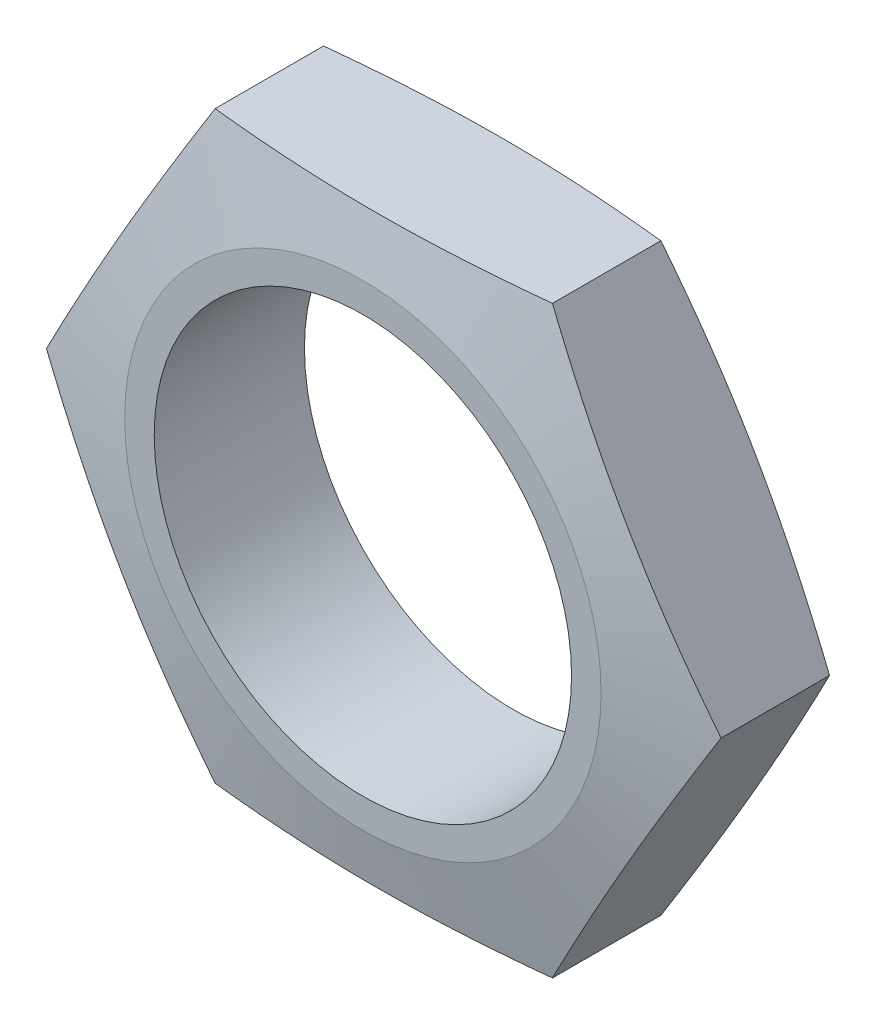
from build123d import *

# Parameters (mm, degrees)
SKETCH2_R          = 6.35
BASE_EXTRUDE_DEPTH = 2.286


with BuildPart() as part:
    # Sketch2 → Base-Extrude (new, symmetric)
    with BuildSketch(Plane.XY):
        Polygon((5.132643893, -8.89), (10.265287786, 0), (5.132643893, 8.89), (-5.132643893, 8.89), (-10.265287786, 0), (-5.132643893, -8.89), align=None)
        Circle(SKETCH2_R, mode=Mode.SUBTRACT)
    extrude(amount=BASE_EXTRUDE_DEPTH, both=True)

    # Sketch4 → Cut-Revolve1 (revolve, cut)
    with BuildSketch(Plane(origin=(0, 0, 0), x_dir=(1, 0, 0), z_dir=(0, 1, 0)), mode=Mode.PRIVATE) as cut_revolve1_sk:
        Polygon((7.247897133, 2.286), (10.265287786, 1.64964364), (10.265287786, 2.286), align=None)
        Polygon((7.247897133, -2.286), (10.265287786, -1.64964364), (10.265287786, -2.286), align=None)
    revolve(cut_revolve1_sk.sketch.rotate(Axis((0, 0, -3.557999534), (0, 0, 1)), 180), axis=Axis((0, 0, -3.557999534), (0, 0, 1)), mode=Mode.SUBTRACT)


solid = part.part
